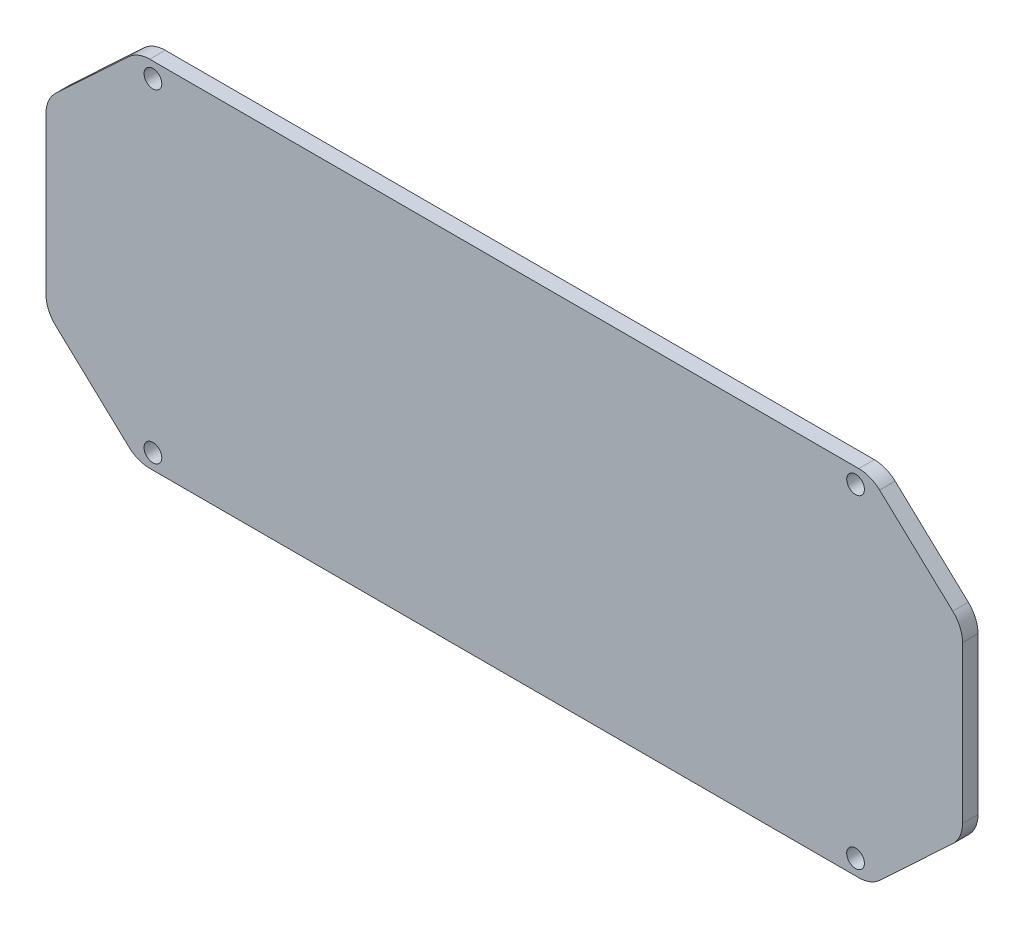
ISO-10303-21;
HEADER;
FILE_DESCRIPTION(('STEP AP214'),'2;1');
FILE_NAME('part.step','',(''),(''),'','','');
FILE_SCHEMA(('AUTOMOTIVE_DESIGN { 1 0 10303 214 1 1 1 1 }'));
ENDSEC;
DATA;
#1=APPLICATION_CONTEXT('core data for automotive mechanical design processes');
#2=APPLICATION_PROTOCOL_DEFINITION('international standard','automotive_design',2000,#1);
#3=PRODUCT_CONTEXT('',#1,'mechanical');
#4=PRODUCT('Part','Part','',(#3));
#5=PRODUCT_RELATED_PRODUCT_CATEGORY('part','',(#4));
#6=PRODUCT_DEFINITION_FORMATION('','',#4);
#7=PRODUCT_DEFINITION_CONTEXT('part definition',#1,'design');
#8=PRODUCT_DEFINITION('design','',#6,#7);
#9=PRODUCT_DEFINITION_SHAPE('','',#8);
#10=(LENGTH_UNIT() NAMED_UNIT(*) SI_UNIT(.MILLI.,.METRE.));
#11=(NAMED_UNIT(*) PLANE_ANGLE_UNIT() SI_UNIT($,.RADIAN.));
#12=(NAMED_UNIT(*) SI_UNIT($,.STERADIAN.) SOLID_ANGLE_UNIT());
#13=UNCERTAINTY_MEASURE_WITH_UNIT(LENGTH_MEASURE(1.E-05),#10,'distance_accuracy_value','');
#14=(GEOMETRIC_REPRESENTATION_CONTEXT(3) GLOBAL_UNCERTAINTY_ASSIGNED_CONTEXT((#13)) GLOBAL_UNIT_ASSIGNED_CONTEXT((#10,
#11,#12)) REPRESENTATION_CONTEXT('',''));
#15=CARTESIAN_POINT('',(0.,0.,0.));
#16=DIRECTION('',(0.,0.,1.));
#17=DIRECTION('',(1.,0.,0.));
#18=AXIS2_PLACEMENT_3D('',#15,#16,#17);
#19=CARTESIAN_POINT('',(-42.3990498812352,-45.4275534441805,2.54));
#20=DIRECTION('',(0.682318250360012,0.731055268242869,0.));
#21=DIRECTION('',(-0.731055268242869,0.682318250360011,0.));
#22=AXIS2_PLACEMENT_3D('',#19,#20,#21);
#23=PLANE('',#22);
#24=DIRECTION('',(0.731055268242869,-0.682318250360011,0.));
#25=VECTOR('',#24,1.);
#26=CARTESIAN_POINT('',(-42.3990498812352,-45.4275534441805,0.));
#27=LINE('',#26,#25);
#28=CARTESIAN_POINT('',(-73.4115912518,-16.4825148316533,0.));
#29=VERTEX_POINT('',#28);
#30=CARTESIAN_POINT('',(-61.4407753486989,-27.6552763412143,0.));
#31=VERTEX_POINT('',#30);
#32=EDGE_CURVE('E310',#29,#31,#27,.T.);
#33=ORIENTED_EDGE('',*,*,#32,.T.);
#34=DIRECTION('',(0.,0.,-1.));
#35=VECTOR('',#34,1.);
#36=CARTESIAN_POINT('',(-61.4407753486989,-27.6552763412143,2.54));
#37=LINE('',#36,#35);
#38=CARTESIAN_POINT('',(-61.4407753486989,-27.6552763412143,2.54));
#39=VERTEX_POINT('',#38);
#40=EDGE_CURVE('E218',#31,#39,#37,.F.);
#41=ORIENTED_EDGE('',*,*,#40,.T.);
#42=DIRECTION('',(0.731055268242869,-0.682318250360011,0.));
#43=VECTOR('',#42,1.);
#44=CARTESIAN_POINT('',(-42.3990498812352,-45.4275534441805,2.54));
#45=LINE('',#44,#43);
#46=CARTESIAN_POINT('',(-73.4115912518,-16.4825148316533,2.54));
#47=VERTEX_POINT('',#46);
#48=EDGE_CURVE('E287',#47,#39,#45,.T.);
#49=ORIENTED_EDGE('',*,*,#48,.F.);
#50=DIRECTION('',(0.,0.,-1.));
#51=VECTOR('',#50,1.);
#52=CARTESIAN_POINT('',(-73.4115912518,-16.4825148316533,0.));
#53=LINE('',#52,#51);
#54=EDGE_CURVE('E215',#47,#29,#53,.T.);
#55=ORIENTED_EDGE('',*,*,#54,.T.);
#56=EDGE_LOOP('',(#33,#41,#49,#55));
#57=FACE_BOUND('',#56,.T.);
#58=ADVANCED_FACE('F35',(#57),#23,.F.);
#59=CARTESIAN_POINT('',(0.,-29.,2.54));
#60=DIRECTION('',(0.,1.,0.));
#61=DIRECTION('',(0.,0.,1.));
#62=AXIS2_PLACEMENT_3D('',#59,#60,#61);
#63=PLANE('',#62);
#64=DIRECTION('',(1.,0.,0.));
#65=VECTOR('',#64,1.);
#66=CARTESIAN_POINT('',(0.,-29.,0.));
#67=LINE('',#66,#65);
#68=CARTESIAN_POINT('',(-58.0291840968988,-29.,0.));
#69=VERTEX_POINT('',#68);
#70=CARTESIAN_POINT('',(58.0291840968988,-29.,0.));
#71=VERTEX_POINT('',#70);
#72=EDGE_CURVE('E170',#69,#71,#67,.T.);
#73=ORIENTED_EDGE('',*,*,#72,.T.);
#74=DIRECTION('',(0.,0.,-1.));
#75=VECTOR('',#74,1.);
#76=CARTESIAN_POINT('',(58.0291840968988,-29.,2.54));
#77=LINE('',#76,#75);
#78=CARTESIAN_POINT('',(58.0291840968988,-29.,2.54));
#79=VERTEX_POINT('',#78);
#80=EDGE_CURVE('E199',#71,#79,#77,.F.);
#81=ORIENTED_EDGE('',*,*,#80,.T.);
#82=DIRECTION('',(1.,0.,0.));
#83=VECTOR('',#82,1.);
#84=CARTESIAN_POINT('',(0.,-29.,2.54));
#85=LINE('',#84,#83);
#86=CARTESIAN_POINT('',(-58.0291840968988,-29.,2.54));
#87=VERTEX_POINT('',#86);
#88=EDGE_CURVE('E290',#87,#79,#85,.T.);
#89=ORIENTED_EDGE('',*,*,#88,.F.);
#90=DIRECTION('',(0.,0.,-1.));
#91=VECTOR('',#90,1.);
#92=CARTESIAN_POINT('',(-58.0291840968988,-29.,2.54));
#93=LINE('',#92,#91);
#94=EDGE_CURVE('E196',#87,#69,#93,.T.);
#95=ORIENTED_EDGE('',*,*,#94,.T.);
#96=EDGE_LOOP('',(#73,#81,#89,#95));
#97=FACE_BOUND('',#96,.T.);
#98=ADVANCED_FACE('F317',(#97),#63,.F.);
#99=CARTESIAN_POINT('',(42.3990498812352,-45.4275534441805,2.54));
#100=DIRECTION('',(0.682318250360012,-0.731055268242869,0.));
#101=DIRECTION('',(0.731055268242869,0.682318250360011,0.));
#102=AXIS2_PLACEMENT_3D('',#99,#100,#101);
#103=PLANE('',#102);
#104=DIRECTION('',(-0.731055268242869,-0.682318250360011,0.));
#105=VECTOR('',#104,1.);
#106=CARTESIAN_POINT('',(42.3990498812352,-45.4275534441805,2.54));
#107=LINE('',#106,#105);
#108=CARTESIAN_POINT('',(73.4115912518,-16.4825148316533,2.54));
#109=VERTEX_POINT('',#108);
#110=CARTESIAN_POINT('',(61.4407753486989,-27.6552763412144,2.54));
#111=VERTEX_POINT('',#110);
#112=EDGE_CURVE('E251',#109,#111,#107,.T.);
#113=ORIENTED_EDGE('',*,*,#112,.T.);
#114=DIRECTION('',(0.,0.,-1.));
#115=VECTOR('',#114,1.);
#116=CARTESIAN_POINT('',(61.4407753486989,-27.6552763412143,0.));
#117=LINE('',#116,#115);
#118=CARTESIAN_POINT('',(61.4407753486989,-27.6552763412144,0.));
#119=VERTEX_POINT('',#118);
#120=EDGE_CURVE('E169',#111,#119,#117,.T.);
#121=ORIENTED_EDGE('',*,*,#120,.T.);
#122=DIRECTION('',(-0.731055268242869,-0.682318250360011,0.));
#123=VECTOR('',#122,1.);
#124=CARTESIAN_POINT('',(42.3990498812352,-45.4275534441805,0.));
#125=LINE('',#124,#123);
#126=CARTESIAN_POINT('',(73.4115912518,-16.4825148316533,0.));
#127=VERTEX_POINT('',#126);
#128=EDGE_CURVE('E153',#127,#119,#125,.T.);
#129=ORIENTED_EDGE('',*,*,#128,.F.);
#130=DIRECTION('',(0.,0.,-1.));
#131=VECTOR('',#130,1.);
#132=CARTESIAN_POINT('',(73.4115912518,-16.4825148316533,2.54));
#133=LINE('',#132,#131);
#134=EDGE_CURVE('E166',#127,#109,#133,.F.);
#135=ORIENTED_EDGE('',*,*,#134,.T.);
#136=EDGE_LOOP('',(#113,#121,#129,#135));
#137=FACE_BOUND('',#136,.T.);
#138=ADVANCED_FACE('F165',(#137),#103,.T.);
#139=CARTESIAN_POINT('',(75.,0.,2.54));
#140=DIRECTION('',(-1.,0.,0.));
#141=DIRECTION('',(0.,0.,1.));
#142=AXIS2_PLACEMENT_3D('',#139,#140,#141);
#143=PLANE('',#142);
#144=DIRECTION('',(0.,1.,0.));
#145=VECTOR('',#144,1.);
#146=CARTESIAN_POINT('',(75.,0.,2.54));
#147=LINE('',#146,#145);
#148=CARTESIAN_POINT('',(75.,-12.8272384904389,2.54));
#149=VERTEX_POINT('',#148);
#150=CARTESIAN_POINT('',(75.,12.8272384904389,2.54));
#151=VERTEX_POINT('',#150);
#152=EDGE_CURVE('E243',#149,#151,#147,.T.);
#153=ORIENTED_EDGE('',*,*,#152,.F.);
#154=DIRECTION('',(0.,0.,-1.));
#155=VECTOR('',#154,1.);
#156=CARTESIAN_POINT('',(75.,-12.8272384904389,0.));
#157=LINE('',#156,#155);
#158=CARTESIAN_POINT('',(75.,-12.8272384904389,0.));
#159=VERTEX_POINT('',#158);
#160=EDGE_CURVE('E11',#149,#159,#157,.T.);
#161=ORIENTED_EDGE('',*,*,#160,.T.);
#162=DIRECTION('',(0.,1.,0.));
#163=VECTOR('',#162,1.);
#164=CARTESIAN_POINT('',(75.,0.,0.));
#165=LINE('',#164,#163);
#166=CARTESIAN_POINT('',(75.,12.8272384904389,0.));
#167=VERTEX_POINT('',#166);
#168=EDGE_CURVE('E155',#159,#167,#165,.T.);
#169=ORIENTED_EDGE('',*,*,#168,.T.);
#170=DIRECTION('',(0.,0.,-1.));
#171=VECTOR('',#170,1.);
#172=CARTESIAN_POINT('',(75.,12.8272384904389,2.54));
#173=LINE('',#172,#171);
#174=EDGE_CURVE('E43',#167,#151,#173,.F.);
#175=ORIENTED_EDGE('',*,*,#174,.T.);
#176=EDGE_LOOP('',(#153,#161,#169,#175));
#177=FACE_BOUND('',#176,.T.);
#178=ADVANCED_FACE('F242',(#177),#143,.F.);
#179=CARTESIAN_POINT('',(42.3990498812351,45.4275534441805,2.54));
#180=DIRECTION('',(0.682318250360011,0.731055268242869,0.));
#181=DIRECTION('',(-0.731055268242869,0.682318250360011,0.));
#182=AXIS2_PLACEMENT_3D('',#179,#180,#181);
#183=PLANE('',#182);
#184=DIRECTION('',(0.731055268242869,-0.682318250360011,0.));
#185=VECTOR('',#184,1.);
#186=CARTESIAN_POINT('',(42.3990498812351,45.4275534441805,0.));
#187=LINE('',#186,#185);
#188=CARTESIAN_POINT('',(61.4407753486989,27.6552763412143,0.));
#189=VERTEX_POINT('',#188);
#190=CARTESIAN_POINT('',(73.4115912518,16.4825148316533,0.));
#191=VERTEX_POINT('',#190);
#192=EDGE_CURVE('E259',#189,#191,#187,.T.);
#193=ORIENTED_EDGE('',*,*,#192,.F.);
#194=DIRECTION('',(0.,0.,-1.));
#195=VECTOR('',#194,1.);
#196=CARTESIAN_POINT('',(61.4407753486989,27.6552763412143,2.54));
#197=LINE('',#196,#195);
#198=CARTESIAN_POINT('',(61.4407753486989,27.6552763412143,2.54));
#199=VERTEX_POINT('',#198);
#200=EDGE_CURVE('E228',#189,#199,#197,.F.);
#201=ORIENTED_EDGE('',*,*,#200,.T.);
#202=DIRECTION('',(0.731055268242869,-0.682318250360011,0.));
#203=VECTOR('',#202,1.);
#204=CARTESIAN_POINT('',(42.3990498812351,45.4275534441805,2.54));
#205=LINE('',#204,#203);
#206=CARTESIAN_POINT('',(73.4115912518,16.4825148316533,2.54));
#207=VERTEX_POINT('',#206);
#208=EDGE_CURVE('E250',#199,#207,#205,.T.);
#209=ORIENTED_EDGE('',*,*,#208,.T.);
#210=DIRECTION('',(0.,0.,-1.));
#211=VECTOR('',#210,1.);
#212=CARTESIAN_POINT('',(73.4115912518,16.4825148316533,0.));
#213=LINE('',#212,#211);
#214=EDGE_CURVE('E225',#207,#191,#213,.T.);
#215=ORIENTED_EDGE('',*,*,#214,.T.);
#216=EDGE_LOOP('',(#193,#201,#209,#215));
#217=FACE_BOUND('',#216,.T.);
#218=ADVANCED_FACE('F258',(#217),#183,.T.);
#219=CARTESIAN_POINT('',(0.,29.,2.54));
#220=DIRECTION('',(0.,1.,0.));
#221=DIRECTION('',(0.,0.,1.));
#222=AXIS2_PLACEMENT_3D('',#219,#220,#221);
#223=PLANE('',#222);
#224=DIRECTION('',(1.,0.,0.));
#225=VECTOR('',#224,1.);
#226=CARTESIAN_POINT('',(0.,29.,2.54));
#227=LINE('',#226,#225);
#228=CARTESIAN_POINT('',(-58.0291840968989,29.,2.54));
#229=VERTEX_POINT('',#228);
#230=CARTESIAN_POINT('',(58.0291840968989,29.,2.54));
#231=VERTEX_POINT('',#230);
#232=EDGE_CURVE('E294',#229,#231,#227,.T.);
#233=ORIENTED_EDGE('',*,*,#232,.T.);
#234=DIRECTION('',(0.,0.,-1.));
#235=VECTOR('',#234,1.);
#236=CARTESIAN_POINT('',(58.0291840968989,29.,2.54));
#237=LINE('',#236,#235);
#238=CARTESIAN_POINT('',(58.0291840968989,29.,0.));
#239=VERTEX_POINT('',#238);
#240=EDGE_CURVE('E222',#231,#239,#237,.T.);
#241=ORIENTED_EDGE('',*,*,#240,.T.);
#242=DIRECTION('',(1.,0.,0.));
#243=VECTOR('',#242,1.);
#244=CARTESIAN_POINT('',(0.,29.,0.));
#245=LINE('',#244,#243);
#246=CARTESIAN_POINT('',(-58.0291840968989,29.,0.));
#247=VERTEX_POINT('',#246);
#248=EDGE_CURVE('E262',#247,#239,#245,.T.);
#249=ORIENTED_EDGE('',*,*,#248,.F.);
#250=DIRECTION('',(0.,0.,-1.));
#251=VECTOR('',#250,1.);
#252=CARTESIAN_POINT('',(-58.0291840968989,29.,2.54));
#253=LINE('',#252,#251);
#254=EDGE_CURVE('E220',#247,#229,#253,.F.);
#255=ORIENTED_EDGE('',*,*,#254,.T.);
#256=EDGE_LOOP('',(#233,#241,#249,#255));
#257=FACE_BOUND('',#256,.T.);
#258=ADVANCED_FACE('F342',(#257),#223,.T.);
#259=CARTESIAN_POINT('',(-42.3990498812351,45.4275534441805,2.54));
#260=DIRECTION('',(0.682318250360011,-0.731055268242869,0.));
#261=DIRECTION('',(0.731055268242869,0.682318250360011,0.));
#262=AXIS2_PLACEMENT_3D('',#259,#260,#261);
#263=PLANE('',#262);
#264=DIRECTION('',(-0.731055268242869,-0.682318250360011,0.));
#265=VECTOR('',#264,1.);
#266=CARTESIAN_POINT('',(-42.3990498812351,45.4275534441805,2.54));
#267=LINE('',#266,#265);
#268=CARTESIAN_POINT('',(-61.4407753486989,27.6552763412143,2.54));
#269=VERTEX_POINT('',#268);
#270=CARTESIAN_POINT('',(-73.4115912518,16.4825148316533,2.54));
#271=VERTEX_POINT('',#270);
#272=EDGE_CURVE('E179',#269,#271,#267,.T.);
#273=ORIENTED_EDGE('',*,*,#272,.F.);
#274=DIRECTION('',(0.,0.,-1.));
#275=VECTOR('',#274,1.);
#276=CARTESIAN_POINT('',(-61.4407753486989,27.6552763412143,0.));
#277=LINE('',#276,#275);
#278=CARTESIAN_POINT('',(-61.4407753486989,27.6552763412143,0.));
#279=VERTEX_POINT('',#278);
#280=EDGE_CURVE('E232',#269,#279,#277,.T.);
#281=ORIENTED_EDGE('',*,*,#280,.T.);
#282=DIRECTION('',(-0.731055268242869,-0.682318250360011,0.));
#283=VECTOR('',#282,1.);
#284=CARTESIAN_POINT('',(-42.3990498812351,45.4275534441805,0.));
#285=LINE('',#284,#283);
#286=CARTESIAN_POINT('',(-73.4115912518,16.4825148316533,0.));
#287=VERTEX_POINT('',#286);
#288=EDGE_CURVE('E264',#279,#287,#285,.T.);
#289=ORIENTED_EDGE('',*,*,#288,.T.);
#290=DIRECTION('',(0.,0.,-1.));
#291=VECTOR('',#290,1.);
#292=CARTESIAN_POINT('',(-73.4115912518,16.4825148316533,2.54));
#293=LINE('',#292,#291);
#294=EDGE_CURVE('E230',#287,#271,#293,.F.);
#295=ORIENTED_EDGE('',*,*,#294,.T.);
#296=EDGE_LOOP('',(#273,#281,#289,#295));
#297=FACE_BOUND('',#296,.T.);
#298=ADVANCED_FACE('F348',(#297),#263,.F.);
#299=CARTESIAN_POINT('',(-57.5,26.5,2.54));
#300=DIRECTION('',(0.,0.,-1.));
#301=DIRECTION('',(-1.,0.,0.));
#302=AXIS2_PLACEMENT_3D('',#299,#300,#301);
#303=CYLINDRICAL_SURFACE('',#302,1.44999999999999);
#304=CARTESIAN_POINT('',(-57.5,26.5,2.54));
#305=DIRECTION('',(0.,0.,1.));
#306=DIRECTION('',(1.,0.,0.));
#307=AXIS2_PLACEMENT_3D('',#304,#305,#306);
#308=CIRCLE('',#307,1.44999999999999);
#309=CARTESIAN_POINT('',(-56.05,26.5,2.54));
#310=VERTEX_POINT('',#309);
#311=EDGE_CURVE('E284',#310,#310,#308,.T.);
#312=ORIENTED_EDGE('',*,*,#311,.T.);
#313=EDGE_LOOP('',(#312));
#314=FACE_BOUND('',#313,.T.);
#315=CARTESIAN_POINT('',(-57.5,26.5,0.));
#316=DIRECTION('',(0.,0.,1.));
#317=DIRECTION('',(1.,0.,0.));
#318=AXIS2_PLACEMENT_3D('',#315,#316,#317);
#319=CIRCLE('',#318,1.44999999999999);
#320=CARTESIAN_POINT('',(-56.05,26.5,0.));
#321=VERTEX_POINT('',#320);
#322=EDGE_CURVE('E307',#321,#321,#319,.T.);
#323=ORIENTED_EDGE('',*,*,#322,.F.);
#324=EDGE_LOOP('',(#323));
#325=FACE_BOUND('',#324,.T.);
#326=ADVANCED_FACE('F350',(#314,#325),#303,.F.);
#327=CARTESIAN_POINT('',(-57.5,-26.5,2.54));
#328=DIRECTION('',(0.,0.,-1.));
#329=DIRECTION('',(-1.,0.,0.));
#330=AXIS2_PLACEMENT_3D('',#327,#328,#329);
#331=CYLINDRICAL_SURFACE('',#330,1.44999999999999);
#332=CARTESIAN_POINT('',(-57.5,-26.5,2.54));
#333=DIRECTION('',(0.,0.,1.));
#334=DIRECTION('',(1.,0.,0.));
#335=AXIS2_PLACEMENT_3D('',#332,#333,#334);
#336=CIRCLE('',#335,1.44999999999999);
#337=CARTESIAN_POINT('',(-56.05,-26.5,2.54));
#338=VERTEX_POINT('',#337);
#339=EDGE_CURVE('E279',#338,#338,#336,.T.);
#340=ORIENTED_EDGE('',*,*,#339,.T.);
#341=EDGE_LOOP('',(#340));
#342=FACE_BOUND('',#341,.T.);
#343=CARTESIAN_POINT('',(-57.5,-26.5,0.));
#344=DIRECTION('',(0.,0.,1.));
#345=DIRECTION('',(1.,0.,0.));
#346=AXIS2_PLACEMENT_3D('',#343,#344,#345);
#347=CIRCLE('',#346,1.44999999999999);
#348=CARTESIAN_POINT('',(-56.05,-26.5,0.));
#349=VERTEX_POINT('',#348);
#350=EDGE_CURVE('E304',#349,#349,#347,.T.);
#351=ORIENTED_EDGE('',*,*,#350,.F.);
#352=EDGE_LOOP('',(#351));
#353=FACE_BOUND('',#352,.T.);
#354=ADVANCED_FACE('F356',(#342,#353),#331,.F.);
#355=CARTESIAN_POINT('',(57.5,26.5,2.54));
#356=DIRECTION('',(0.,0.,-1.));
#357=DIRECTION('',(-1.,0.,0.));
#358=AXIS2_PLACEMENT_3D('',#355,#356,#357);
#359=CYLINDRICAL_SURFACE('',#358,1.44999999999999);
#360=CARTESIAN_POINT('',(57.5,26.5,2.54));
#361=DIRECTION('',(0.,0.,1.));
#362=DIRECTION('',(1.,0.,0.));
#363=AXIS2_PLACEMENT_3D('',#360,#361,#362);
#364=CIRCLE('',#363,1.44999999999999);
#365=CARTESIAN_POINT('',(58.95,26.5,2.54));
#366=VERTEX_POINT('',#365);
#367=EDGE_CURVE('E274',#366,#366,#364,.T.);
#368=ORIENTED_EDGE('',*,*,#367,.T.);
#369=EDGE_LOOP('',(#368));
#370=FACE_BOUND('',#369,.T.);
#371=CARTESIAN_POINT('',(57.5,26.5,0.));
#372=DIRECTION('',(0.,0.,1.));
#373=DIRECTION('',(1.,0.,0.));
#374=AXIS2_PLACEMENT_3D('',#371,#372,#373);
#375=CIRCLE('',#374,1.44999999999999);
#376=CARTESIAN_POINT('',(58.95,26.5,0.));
#377=VERTEX_POINT('',#376);
#378=EDGE_CURVE('E301',#377,#377,#375,.T.);
#379=ORIENTED_EDGE('',*,*,#378,.F.);
#380=EDGE_LOOP('',(#379));
#381=FACE_BOUND('',#380,.T.);
#382=ADVANCED_FACE('F371',(#370,#381),#359,.F.);
#383=CARTESIAN_POINT('',(57.5,-26.5,2.54));
#384=DIRECTION('',(0.,0.,-1.));
#385=DIRECTION('',(-1.,0.,0.));
#386=AXIS2_PLACEMENT_3D('',#383,#384,#385);
#387=CYLINDRICAL_SURFACE('',#386,1.44999999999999);
#388=CARTESIAN_POINT('',(57.5,-26.5,2.54));
#389=DIRECTION('',(0.,0.,1.));
#390=DIRECTION('',(1.,0.,0.));
#391=AXIS2_PLACEMENT_3D('',#388,#389,#390);
#392=CIRCLE('',#391,1.44999999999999);
#393=CARTESIAN_POINT('',(58.95,-26.5,2.54));
#394=VERTEX_POINT('',#393);
#395=EDGE_CURVE('E272',#394,#394,#392,.T.);
#396=ORIENTED_EDGE('',*,*,#395,.T.);
#397=EDGE_LOOP('',(#396));
#398=FACE_BOUND('',#397,.T.);
#399=CARTESIAN_POINT('',(57.5,-26.5,0.));
#400=DIRECTION('',(0.,0.,1.));
#401=DIRECTION('',(1.,0.,0.));
#402=AXIS2_PLACEMENT_3D('',#399,#400,#401);
#403=CIRCLE('',#402,1.44999999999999);
#404=CARTESIAN_POINT('',(58.95,-26.5,0.));
#405=VERTEX_POINT('',#404);
#406=EDGE_CURVE('E298',#405,#405,#403,.T.);
#407=ORIENTED_EDGE('',*,*,#406,.F.);
#408=EDGE_LOOP('',(#407));
#409=FACE_BOUND('',#408,.T.);
#410=ADVANCED_FACE('F375',(#398,#409),#387,.F.);
#411=CARTESIAN_POINT('',(-75.,0.,2.54));
#412=DIRECTION('',(-1.,0.,0.));
#413=DIRECTION('',(0.,0.,1.));
#414=AXIS2_PLACEMENT_3D('',#411,#412,#413);
#415=PLANE('',#414);
#416=DIRECTION('',(0.,1.,0.));
#417=VECTOR('',#416,1.);
#418=CARTESIAN_POINT('',(-75.,0.,0.));
#419=LINE('',#418,#417);
#420=CARTESIAN_POINT('',(-75.,-12.8272384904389,0.));
#421=VERTEX_POINT('',#420);
#422=CARTESIAN_POINT('',(-75.,12.827238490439,0.));
#423=VERTEX_POINT('',#422);
#424=EDGE_CURVE('E182',#421,#423,#419,.T.);
#425=ORIENTED_EDGE('',*,*,#424,.F.);
#426=DIRECTION('',(0.,0.,-1.));
#427=VECTOR('',#426,1.);
#428=CARTESIAN_POINT('',(-75.,-12.8272384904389,2.54));
#429=LINE('',#428,#427);
#430=CARTESIAN_POINT('',(-75.,-12.8272384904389,2.54));
#431=VERTEX_POINT('',#430);
#432=EDGE_CURVE('E57',#421,#431,#429,.F.);
#433=ORIENTED_EDGE('',*,*,#432,.T.);
#434=DIRECTION('',(0.,1.,0.));
#435=VECTOR('',#434,1.);
#436=CARTESIAN_POINT('',(-75.,0.,2.54));
#437=LINE('',#436,#435);
#438=CARTESIAN_POINT('',(-75.,12.827238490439,2.54));
#439=VERTEX_POINT('',#438);
#440=EDGE_CURVE('E175',#431,#439,#437,.T.);
#441=ORIENTED_EDGE('',*,*,#440,.T.);
#442=DIRECTION('',(0.,0.,-1.));
#443=VECTOR('',#442,1.);
#444=CARTESIAN_POINT('',(-75.,12.827238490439,0.));
#445=LINE('',#444,#443);
#446=EDGE_CURVE('E235',#439,#423,#445,.T.);
#447=ORIENTED_EDGE('',*,*,#446,.T.);
#448=EDGE_LOOP('',(#425,#433,#441,#447));
#449=FACE_BOUND('',#448,.T.);
#450=ADVANCED_FACE('F334',(#449),#415,.T.);
#451=CARTESIAN_POINT('',(0.,0.,2.54));
#452=DIRECTION('',(0.,0.,1.));
#453=DIRECTION('',(1.,0.,0.));
#454=AXIS2_PLACEMENT_3D('',#451,#452,#453);
#455=PLANE('',#454);
#456=ORIENTED_EDGE('',*,*,#395,.F.);
#457=EDGE_LOOP('',(#456));
#458=FACE_BOUND('',#457,.T.);
#459=ORIENTED_EDGE('',*,*,#367,.F.);
#460=EDGE_LOOP('',(#459));
#461=FACE_BOUND('',#460,.T.);
#462=ORIENTED_EDGE('',*,*,#339,.F.);
#463=EDGE_LOOP('',(#462));
#464=FACE_BOUND('',#463,.T.);
#465=ORIENTED_EDGE('',*,*,#311,.F.);
#466=EDGE_LOOP('',(#465));
#467=FACE_BOUND('',#466,.T.);
#468=ORIENTED_EDGE('',*,*,#88,.T.);
#469=CARTESIAN_POINT('',(58.0291840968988,-24.,2.54));
#470=DIRECTION('',(0.,0.,1.));
#471=DIRECTION('',(1.,0.,0.));
#472=AXIS2_PLACEMENT_3D('',#469,#470,#471);
#473=CIRCLE('',#472,5.);
#474=EDGE_CURVE('E213',#79,#111,#473,.T.);
#475=ORIENTED_EDGE('',*,*,#474,.T.);
#476=ORIENTED_EDGE('',*,*,#112,.F.);
#477=CARTESIAN_POINT('',(70.,-12.8272384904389,2.54));
#478=DIRECTION('',(0.,0.,1.));
#479=DIRECTION('',(1.,0.,0.));
#480=AXIS2_PLACEMENT_3D('',#477,#478,#479);
#481=CIRCLE('',#480,5.);
#482=EDGE_CURVE('E174',#109,#149,#481,.T.);
#483=ORIENTED_EDGE('',*,*,#482,.T.);
#484=ORIENTED_EDGE('',*,*,#152,.T.);
#485=CARTESIAN_POINT('',(70.,12.8272384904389,2.54));
#486=DIRECTION('',(0.,0.,1.));
#487=DIRECTION('',(1.,0.,0.));
#488=AXIS2_PLACEMENT_3D('',#485,#486,#487);
#489=CIRCLE('',#488,5.);
#490=EDGE_CURVE('E202',#151,#207,#489,.T.);
#491=ORIENTED_EDGE('',*,*,#490,.T.);
#492=ORIENTED_EDGE('',*,*,#208,.F.);
#493=CARTESIAN_POINT('',(58.0291840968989,24.,2.54));
#494=DIRECTION('',(0.,0.,1.));
#495=DIRECTION('',(1.,0.,0.));
#496=AXIS2_PLACEMENT_3D('',#493,#494,#495);
#497=CIRCLE('',#496,5.);
#498=EDGE_CURVE('E209',#199,#231,#497,.T.);
#499=ORIENTED_EDGE('',*,*,#498,.T.);
#500=ORIENTED_EDGE('',*,*,#232,.F.);
#501=CARTESIAN_POINT('',(-58.0291840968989,24.,2.54));
#502=DIRECTION('',(0.,0.,1.));
#503=DIRECTION('',(1.,0.,0.));
#504=AXIS2_PLACEMENT_3D('',#501,#502,#503);
#505=CIRCLE('',#504,5.);
#506=EDGE_CURVE('E207',#229,#269,#505,.T.);
#507=ORIENTED_EDGE('',*,*,#506,.T.);
#508=ORIENTED_EDGE('',*,*,#272,.T.);
#509=CARTESIAN_POINT('',(-70.,12.827238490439,2.54));
#510=DIRECTION('',(0.,0.,1.));
#511=DIRECTION('',(1.,0.,0.));
#512=AXIS2_PLACEMENT_3D('',#509,#510,#511);
#513=CIRCLE('',#512,5.);
#514=EDGE_CURVE('E50',#271,#439,#513,.T.);
#515=ORIENTED_EDGE('',*,*,#514,.T.);
#516=ORIENTED_EDGE('',*,*,#440,.F.);
#517=CARTESIAN_POINT('',(-70.,-12.8272384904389,2.54));
#518=DIRECTION('',(0.,0.,1.));
#519=DIRECTION('',(1.,0.,0.));
#520=AXIS2_PLACEMENT_3D('',#517,#518,#519);
#521=CIRCLE('',#520,5.);
#522=EDGE_CURVE('E205',#431,#47,#521,.T.);
#523=ORIENTED_EDGE('',*,*,#522,.T.);
#524=ORIENTED_EDGE('',*,*,#48,.T.);
#525=CARTESIAN_POINT('',(-58.0291840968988,-24.,2.54));
#526=DIRECTION('',(0.,0.,1.));
#527=DIRECTION('',(1.,0.,0.));
#528=AXIS2_PLACEMENT_3D('',#525,#526,#527);
#529=CIRCLE('',#528,5.);
#530=EDGE_CURVE('E211',#39,#87,#529,.T.);
#531=ORIENTED_EDGE('',*,*,#530,.T.);
#532=EDGE_LOOP('',(#468,#475,#476,#483,#484,#491,#492,#499,#500,#507,#508,#515,#516,#523,#524,#531));
#533=FACE_BOUND('',#532,.T.);
#534=ADVANCED_FACE('F247',(#458,#461,#464,#467,#533),#455,.T.);
#535=CARTESIAN_POINT('',(0.,0.,0.));
#536=DIRECTION('',(0.,0.,1.));
#537=DIRECTION('',(1.,0.,0.));
#538=AXIS2_PLACEMENT_3D('',#535,#536,#537);
#539=PLANE('',#538);
#540=ORIENTED_EDGE('',*,*,#406,.T.);
#541=EDGE_LOOP('',(#540));
#542=FACE_BOUND('',#541,.T.);
#543=ORIENTED_EDGE('',*,*,#378,.T.);
#544=EDGE_LOOP('',(#543));
#545=FACE_BOUND('',#544,.T.);
#546=ORIENTED_EDGE('',*,*,#350,.T.);
#547=EDGE_LOOP('',(#546));
#548=FACE_BOUND('',#547,.T.);
#549=ORIENTED_EDGE('',*,*,#322,.T.);
#550=EDGE_LOOP('',(#549));
#551=FACE_BOUND('',#550,.T.);
#552=ORIENTED_EDGE('',*,*,#128,.T.);
#553=CARTESIAN_POINT('',(58.0291840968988,-24.,0.));
#554=DIRECTION('',(0.,0.,1.));
#555=DIRECTION('',(1.,0.,0.));
#556=AXIS2_PLACEMENT_3D('',#553,#554,#555);
#557=CIRCLE('',#556,5.);
#558=EDGE_CURVE('E194',#119,#71,#557,.F.);
#559=ORIENTED_EDGE('',*,*,#558,.T.);
#560=ORIENTED_EDGE('',*,*,#72,.F.);
#561=CARTESIAN_POINT('',(-58.0291840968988,-24.,0.));
#562=DIRECTION('',(0.,0.,1.));
#563=DIRECTION('',(1.,0.,0.));
#564=AXIS2_PLACEMENT_3D('',#561,#562,#563);
#565=CIRCLE('',#564,5.);
#566=EDGE_CURVE('E192',#69,#31,#565,.F.);
#567=ORIENTED_EDGE('',*,*,#566,.T.);
#568=ORIENTED_EDGE('',*,*,#32,.F.);
#569=CARTESIAN_POINT('',(-70.,-12.8272384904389,0.));
#570=DIRECTION('',(0.,0.,1.));
#571=DIRECTION('',(1.,0.,0.));
#572=AXIS2_PLACEMENT_3D('',#569,#570,#571);
#573=CIRCLE('',#572,5.);
#574=EDGE_CURVE('E159',#29,#421,#573,.F.);
#575=ORIENTED_EDGE('',*,*,#574,.T.);
#576=ORIENTED_EDGE('',*,*,#424,.T.);
#577=CARTESIAN_POINT('',(-70.,12.827238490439,0.));
#578=DIRECTION('',(0.,0.,1.));
#579=DIRECTION('',(1.,0.,0.));
#580=AXIS2_PLACEMENT_3D('',#577,#578,#579);
#581=CIRCLE('',#580,5.);
#582=EDGE_CURVE('E177',#423,#287,#581,.F.);
#583=ORIENTED_EDGE('',*,*,#582,.T.);
#584=ORIENTED_EDGE('',*,*,#288,.F.);
#585=CARTESIAN_POINT('',(-58.0291840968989,24.,0.));
#586=DIRECTION('',(0.,0.,1.));
#587=DIRECTION('',(1.,0.,0.));
#588=AXIS2_PLACEMENT_3D('',#585,#586,#587);
#589=CIRCLE('',#588,5.);
#590=EDGE_CURVE('E188',#279,#247,#589,.F.);
#591=ORIENTED_EDGE('',*,*,#590,.T.);
#592=ORIENTED_EDGE('',*,*,#248,.T.);
#593=CARTESIAN_POINT('',(58.0291840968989,24.,0.));
#594=DIRECTION('',(0.,0.,1.));
#595=DIRECTION('',(1.,0.,0.));
#596=AXIS2_PLACEMENT_3D('',#593,#594,#595);
#597=CIRCLE('',#596,5.);
#598=EDGE_CURVE('E190',#239,#189,#597,.F.);
#599=ORIENTED_EDGE('',*,*,#598,.T.);
#600=ORIENTED_EDGE('',*,*,#192,.T.);
#601=CARTESIAN_POINT('',(70.,12.8272384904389,0.));
#602=DIRECTION('',(0.,0.,1.));
#603=DIRECTION('',(1.,0.,0.));
#604=AXIS2_PLACEMENT_3D('',#601,#602,#603);
#605=CIRCLE('',#604,5.);
#606=EDGE_CURVE('E160',#191,#167,#605,.F.);
#607=ORIENTED_EDGE('',*,*,#606,.T.);
#608=ORIENTED_EDGE('',*,*,#168,.F.);
#609=CARTESIAN_POINT('',(70.,-12.8272384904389,0.));
#610=DIRECTION('',(0.,0.,1.));
#611=DIRECTION('',(1.,0.,0.));
#612=AXIS2_PLACEMENT_3D('',#609,#610,#611);
#613=CIRCLE('',#612,5.);
#614=EDGE_CURVE('E150',#159,#127,#613,.F.);
#615=ORIENTED_EDGE('',*,*,#614,.T.);
#616=EDGE_LOOP('',(#552,#559,#560,#567,#568,#575,#576,#583,#584,#591,#592,#599,#600,#607,#608,#615));
#617=FACE_BOUND('',#616,.T.);
#618=ADVANCED_FACE('F152',(#542,#545,#548,#551,#617),#539,.F.);
#619=CARTESIAN_POINT('',(58.0291840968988,-24.,2.54));
#620=DIRECTION('',(0.,0.,1.));
#621=DIRECTION('',(1.,0.,0.));
#622=AXIS2_PLACEMENT_3D('',#619,#620,#621);
#623=CYLINDRICAL_SURFACE('',#622,5.);
#624=ORIENTED_EDGE('',*,*,#474,.F.);
#625=ORIENTED_EDGE('',*,*,#80,.F.);
#626=ORIENTED_EDGE('',*,*,#558,.F.);
#627=ORIENTED_EDGE('',*,*,#120,.F.);
#628=EDGE_LOOP('',(#624,#625,#626,#627));
#629=FACE_BOUND('',#628,.T.);
#630=ADVANCED_FACE('F322',(#629),#623,.T.);
#631=CARTESIAN_POINT('',(-58.0291840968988,-24.,2.54));
#632=DIRECTION('',(0.,0.,-1.));
#633=DIRECTION('',(-1.,0.,0.));
#634=AXIS2_PLACEMENT_3D('',#631,#632,#633);
#635=CYLINDRICAL_SURFACE('',#634,5.);
#636=ORIENTED_EDGE('',*,*,#530,.F.);
#637=ORIENTED_EDGE('',*,*,#40,.F.);
#638=ORIENTED_EDGE('',*,*,#566,.F.);
#639=ORIENTED_EDGE('',*,*,#94,.F.);
#640=EDGE_LOOP('',(#636,#637,#638,#639));
#641=FACE_BOUND('',#640,.T.);
#642=ADVANCED_FACE('F325',(#641),#635,.T.);
#643=CARTESIAN_POINT('',(58.0291840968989,24.,2.54));
#644=DIRECTION('',(0.,0.,-1.));
#645=DIRECTION('',(-1.,0.,0.));
#646=AXIS2_PLACEMENT_3D('',#643,#644,#645);
#647=CYLINDRICAL_SURFACE('',#646,5.);
#648=ORIENTED_EDGE('',*,*,#498,.F.);
#649=ORIENTED_EDGE('',*,*,#200,.F.);
#650=ORIENTED_EDGE('',*,*,#598,.F.);
#651=ORIENTED_EDGE('',*,*,#240,.F.);
#652=EDGE_LOOP('',(#648,#649,#650,#651));
#653=FACE_BOUND('',#652,.T.);
#654=ADVANCED_FACE('F383',(#653),#647,.T.);
#655=CARTESIAN_POINT('',(-58.0291840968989,24.,2.54));
#656=DIRECTION('',(0.,0.,1.));
#657=DIRECTION('',(1.,0.,0.));
#658=AXIS2_PLACEMENT_3D('',#655,#656,#657);
#659=CYLINDRICAL_SURFACE('',#658,5.);
#660=ORIENTED_EDGE('',*,*,#506,.F.);
#661=ORIENTED_EDGE('',*,*,#254,.F.);
#662=ORIENTED_EDGE('',*,*,#590,.F.);
#663=ORIENTED_EDGE('',*,*,#280,.F.);
#664=EDGE_LOOP('',(#660,#661,#662,#663));
#665=FACE_BOUND('',#664,.T.);
#666=ADVANCED_FACE('F346',(#665),#659,.T.);
#667=CARTESIAN_POINT('',(-70.,-12.8272384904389,2.54));
#668=DIRECTION('',(0.,0.,1.));
#669=DIRECTION('',(1.,0.,0.));
#670=AXIS2_PLACEMENT_3D('',#667,#668,#669);
#671=CYLINDRICAL_SURFACE('',#670,5.);
#672=ORIENTED_EDGE('',*,*,#522,.F.);
#673=ORIENTED_EDGE('',*,*,#432,.F.);
#674=ORIENTED_EDGE('',*,*,#574,.F.);
#675=ORIENTED_EDGE('',*,*,#54,.F.);
#676=EDGE_LOOP('',(#672,#673,#674,#675));
#677=FACE_BOUND('',#676,.T.);
#678=ADVANCED_FACE('F333',(#677),#671,.T.);
#679=CARTESIAN_POINT('',(70.,-12.8272384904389,2.54));
#680=DIRECTION('',(0.,0.,1.));
#681=DIRECTION('',(1.,0.,0.));
#682=AXIS2_PLACEMENT_3D('',#679,#680,#681);
#683=CYLINDRICAL_SURFACE('',#682,5.);
#684=ORIENTED_EDGE('',*,*,#482,.F.);
#685=ORIENTED_EDGE('',*,*,#134,.F.);
#686=ORIENTED_EDGE('',*,*,#614,.F.);
#687=ORIENTED_EDGE('',*,*,#160,.F.);
#688=EDGE_LOOP('',(#684,#685,#686,#687));
#689=FACE_BOUND('',#688,.T.);
#690=ADVANCED_FACE('F173',(#689),#683,.T.);
#691=CARTESIAN_POINT('',(70.,12.8272384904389,2.54));
#692=DIRECTION('',(0.,0.,1.));
#693=DIRECTION('',(1.,0.,0.));
#694=AXIS2_PLACEMENT_3D('',#691,#692,#693);
#695=CYLINDRICAL_SURFACE('',#694,5.);
#696=ORIENTED_EDGE('',*,*,#490,.F.);
#697=ORIENTED_EDGE('',*,*,#174,.F.);
#698=ORIENTED_EDGE('',*,*,#606,.F.);
#699=ORIENTED_EDGE('',*,*,#214,.F.);
#700=EDGE_LOOP('',(#696,#697,#698,#699));
#701=FACE_BOUND('',#700,.T.);
#702=ADVANCED_FACE('F254',(#701),#695,.T.);
#703=CARTESIAN_POINT('',(-70.,12.827238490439,2.54));
#704=DIRECTION('',(0.,0.,1.));
#705=DIRECTION('',(1.,0.,0.));
#706=AXIS2_PLACEMENT_3D('',#703,#704,#705);
#707=CYLINDRICAL_SURFACE('',#706,5.);
#708=ORIENTED_EDGE('',*,*,#514,.F.);
#709=ORIENTED_EDGE('',*,*,#294,.F.);
#710=ORIENTED_EDGE('',*,*,#582,.F.);
#711=ORIENTED_EDGE('',*,*,#446,.F.);
#712=EDGE_LOOP('',(#708,#709,#710,#711));
#713=FACE_BOUND('',#712,.T.);
#714=ADVANCED_FACE('F37',(#713),#707,.T.);
#715=CLOSED_SHELL('',(#58,#98,#138,#178,#218,#258,#298,#326,#354,#382,#410,#450,#534,#618,#630,
#642,#654,#666,#678,#690,#702,#714));
#716=MANIFOLD_SOLID_BREP('B2',#715);
#717=ADVANCED_BREP_SHAPE_REPRESENTATION('',(#18,#716),#14);
#718=SHAPE_DEFINITION_REPRESENTATION(#9,#717);
ENDSEC;
END-ISO-10303-21;
